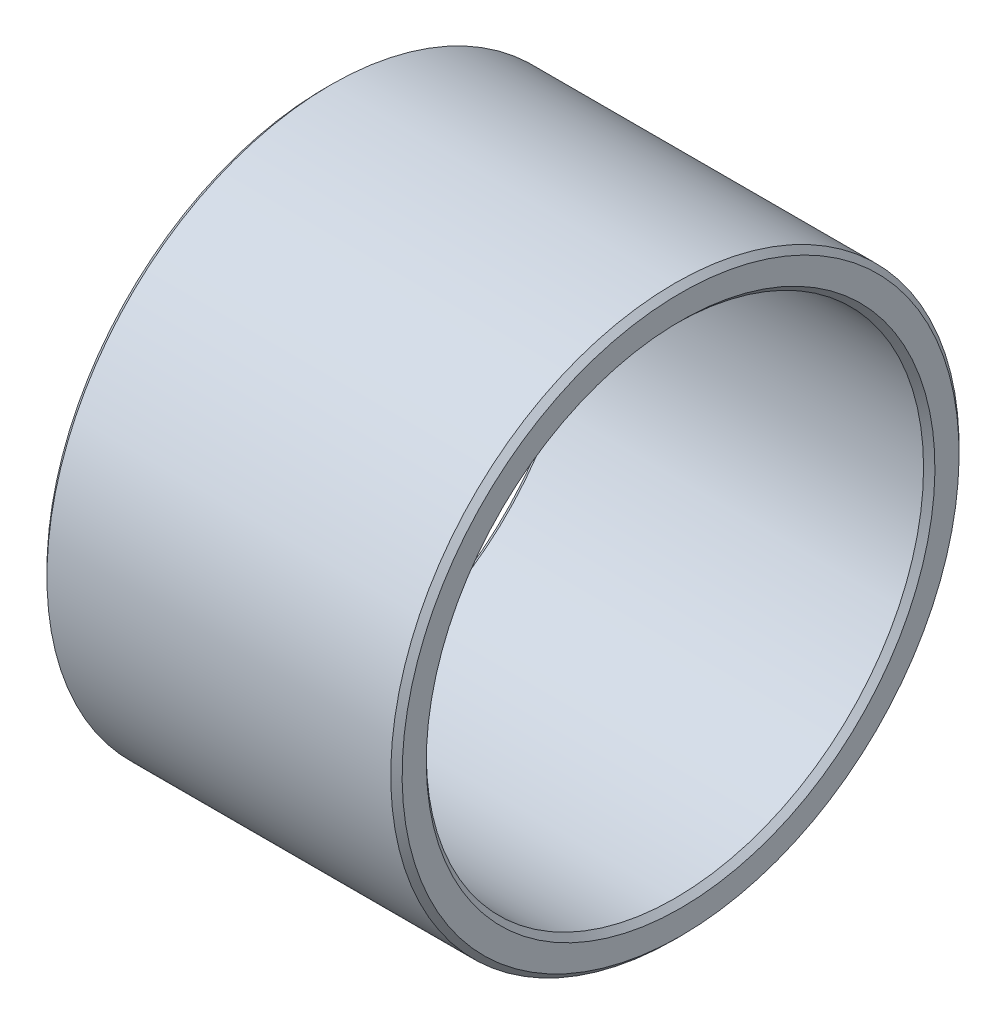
ISO-10303-21;
HEADER;
FILE_DESCRIPTION(('STEP AP214'),'2;1');
FILE_NAME('part.step','',(''),(''),'','','');
FILE_SCHEMA(('AUTOMOTIVE_DESIGN { 1 0 10303 214 1 1 1 1 }'));
ENDSEC;
DATA;
#1=APPLICATION_CONTEXT('core data for automotive mechanical design processes');
#2=APPLICATION_PROTOCOL_DEFINITION('international standard','automotive_design',2000,#1);
#3=PRODUCT_CONTEXT('',#1,'mechanical');
#4=PRODUCT('Part','Part','',(#3));
#5=PRODUCT_RELATED_PRODUCT_CATEGORY('part','',(#4));
#6=PRODUCT_DEFINITION_FORMATION('','',#4);
#7=PRODUCT_DEFINITION_CONTEXT('part definition',#1,'design');
#8=PRODUCT_DEFINITION('design','',#6,#7);
#9=PRODUCT_DEFINITION_SHAPE('','',#8);
#10=(LENGTH_UNIT() NAMED_UNIT(*) SI_UNIT(.MILLI.,.METRE.));
#11=(NAMED_UNIT(*) PLANE_ANGLE_UNIT() SI_UNIT($,.RADIAN.));
#12=(NAMED_UNIT(*) SI_UNIT($,.STERADIAN.) SOLID_ANGLE_UNIT());
#13=UNCERTAINTY_MEASURE_WITH_UNIT(LENGTH_MEASURE(1.E-05),#10,'distance_accuracy_value','');
#14=(GEOMETRIC_REPRESENTATION_CONTEXT(3) GLOBAL_UNCERTAINTY_ASSIGNED_CONTEXT((#13)) GLOBAL_UNIT_ASSIGNED_CONTEXT((#10,
#11,#12)) REPRESENTATION_CONTEXT('',''));
#15=CARTESIAN_POINT('',(0.,0.,0.));
#16=DIRECTION('',(0.,0.,1.));
#17=DIRECTION('',(1.,0.,0.));
#18=AXIS2_PLACEMENT_3D('',#15,#16,#17);
#19=CARTESIAN_POINT('',(0.,-18.75,0.));
#20=DIRECTION('',(-1.,0.,0.));
#21=DIRECTION('',(0.,1.,0.));
#22=AXIS2_PLACEMENT_3D('',#19,#20,#21);
#23=PLANE('',#22);
#24=CARTESIAN_POINT('',(0.,0.,0.));
#25=DIRECTION('',(1.,0.,0.));
#26=DIRECTION('',(0.,-1.,0.));
#27=AXIS2_PLACEMENT_3D('',#24,#25,#26);
#28=CIRCLE('',#27,17.9);
#29=CARTESIAN_POINT('',(0.,-17.9,0.));
#30=VERTEX_POINT('',#29);
#31=EDGE_CURVE('E9',#30,#30,#28,.T.);
#32=ORIENTED_EDGE('',*,*,#31,.T.);
#33=EDGE_LOOP('',(#32));
#34=FACE_BOUND('',#33,.T.);
#35=CARTESIAN_POINT('',(0.,0.,0.));
#36=DIRECTION('',(1.,0.,0.));
#37=DIRECTION('',(0.,-1.,0.));
#38=AXIS2_PLACEMENT_3D('',#35,#36,#37);
#39=CIRCLE('',#38,19.6);
#40=CARTESIAN_POINT('',(0.,-19.6,0.));
#41=VERTEX_POINT('',#40);
#42=EDGE_CURVE('E53',#41,#41,#39,.T.);
#43=ORIENTED_EDGE('',*,*,#42,.F.);
#44=EDGE_LOOP('',(#43));
#45=FACE_BOUND('',#44,.T.);
#46=ADVANCED_FACE('F15',(#34,#45),#23,.T.);
#47=CARTESIAN_POINT('',(0.2,0.,0.));
#48=DIRECTION('',(-1.,0.,0.));
#49=DIRECTION('',(0.,-1.,0.));
#50=AXIS2_PLACEMENT_3D('',#47,#48,#49);
#51=CONICAL_SURFACE('',#50,17.7,0.78539816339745);
#52=CARTESIAN_POINT('',(0.4,0.,0.));
#53=DIRECTION('',(1.,0.,0.));
#54=DIRECTION('',(0.,-1.,0.));
#55=AXIS2_PLACEMENT_3D('',#52,#53,#54);
#56=CIRCLE('',#55,17.5);
#57=CARTESIAN_POINT('',(0.4,-17.5,0.));
#58=VERTEX_POINT('',#57);
#59=EDGE_CURVE('E22',#58,#58,#56,.T.);
#60=ORIENTED_EDGE('',*,*,#59,.T.);
#61=EDGE_LOOP('',(#60));
#62=FACE_BOUND('',#61,.T.);
#63=ORIENTED_EDGE('',*,*,#31,.F.);
#64=EDGE_LOOP('',(#63));
#65=FACE_BOUND('',#64,.T.);
#66=ADVANCED_FACE('F82',(#62,#65),#51,.F.);
#67=CARTESIAN_POINT('',(12.5,0.,0.));
#68=DIRECTION('',(-1.,0.,0.));
#69=DIRECTION('',(0.,-1.,0.));
#70=AXIS2_PLACEMENT_3D('',#67,#68,#69);
#71=CYLINDRICAL_SURFACE('',#70,17.5);
#72=CARTESIAN_POINT('',(24.6,0.,0.));
#73=DIRECTION('',(1.,0.,0.));
#74=DIRECTION('',(0.,-1.,0.));
#75=AXIS2_PLACEMENT_3D('',#72,#73,#74);
#76=CIRCLE('',#75,17.5);
#77=CARTESIAN_POINT('',(24.6,-17.5,0.));
#78=VERTEX_POINT('',#77);
#79=EDGE_CURVE('E58',#78,#78,#76,.T.);
#80=ORIENTED_EDGE('',*,*,#79,.T.);
#81=EDGE_LOOP('',(#80));
#82=FACE_BOUND('',#81,.T.);
#83=ORIENTED_EDGE('',*,*,#59,.F.);
#84=EDGE_LOOP('',(#83));
#85=FACE_BOUND('',#84,.T.);
#86=ADVANCED_FACE('F66',(#82,#85),#71,.F.);
#87=CARTESIAN_POINT('',(24.8,0.,0.));
#88=DIRECTION('',(1.,0.,0.));
#89=DIRECTION('',(0.,-1.,0.));
#90=AXIS2_PLACEMENT_3D('',#87,#88,#89);
#91=CONICAL_SURFACE('',#90,17.7,0.785398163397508);
#92=CARTESIAN_POINT('',(25.,0.,0.));
#93=DIRECTION('',(1.,0.,0.));
#94=DIRECTION('',(0.,-1.,0.));
#95=AXIS2_PLACEMENT_3D('',#92,#93,#94);
#96=CIRCLE('',#95,17.9);
#97=CARTESIAN_POINT('',(25.,-17.9,0.));
#98=VERTEX_POINT('',#97);
#99=EDGE_CURVE('E63',#98,#98,#96,.T.);
#100=ORIENTED_EDGE('',*,*,#99,.T.);
#101=EDGE_LOOP('',(#100));
#102=FACE_BOUND('',#101,.T.);
#103=ORIENTED_EDGE('',*,*,#79,.F.);
#104=EDGE_LOOP('',(#103));
#105=FACE_BOUND('',#104,.T.);
#106=ADVANCED_FACE('F69',(#102,#105),#91,.F.);
#107=CARTESIAN_POINT('',(25.,-18.75,0.));
#108=DIRECTION('',(1.,0.,0.));
#109=DIRECTION('',(0.,-1.,0.));
#110=AXIS2_PLACEMENT_3D('',#107,#108,#109);
#111=PLANE('',#110);
#112=CARTESIAN_POINT('',(25.,0.,0.));
#113=DIRECTION('',(1.,0.,0.));
#114=DIRECTION('',(0.,-1.,0.));
#115=AXIS2_PLACEMENT_3D('',#112,#113,#114);
#116=CIRCLE('',#115,19.6);
#117=CARTESIAN_POINT('',(25.,-19.6,0.));
#118=VERTEX_POINT('',#117);
#119=EDGE_CURVE('E61',#118,#118,#116,.T.);
#120=ORIENTED_EDGE('',*,*,#119,.T.);
#121=EDGE_LOOP('',(#120));
#122=FACE_BOUND('',#121,.T.);
#123=ORIENTED_EDGE('',*,*,#99,.F.);
#124=EDGE_LOOP('',(#123));
#125=FACE_BOUND('',#124,.T.);
#126=ADVANCED_FACE('F71',(#122,#125),#111,.T.);
#127=CARTESIAN_POINT('',(24.8,0.,0.));
#128=DIRECTION('',(-1.,0.,0.));
#129=DIRECTION('',(0.,-1.,0.));
#130=AXIS2_PLACEMENT_3D('',#127,#128,#129);
#131=CONICAL_SURFACE('',#130,19.8,0.785398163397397);
#132=CARTESIAN_POINT('',(24.6,0.,0.));
#133=DIRECTION('',(1.,0.,0.));
#134=DIRECTION('',(0.,-1.,0.));
#135=AXIS2_PLACEMENT_3D('',#132,#133,#134);
#136=CIRCLE('',#135,20.);
#137=CARTESIAN_POINT('',(24.6,-20.,0.));
#138=VERTEX_POINT('',#137);
#139=EDGE_CURVE('E55',#138,#138,#136,.T.);
#140=ORIENTED_EDGE('',*,*,#139,.T.);
#141=EDGE_LOOP('',(#140));
#142=FACE_BOUND('',#141,.T.);
#143=ORIENTED_EDGE('',*,*,#119,.F.);
#144=EDGE_LOOP('',(#143));
#145=FACE_BOUND('',#144,.T.);
#146=ADVANCED_FACE('F79',(#142,#145),#131,.T.);
#147=CARTESIAN_POINT('',(12.5,0.,0.));
#148=DIRECTION('',(-1.,0.,0.));
#149=DIRECTION('',(0.,-1.,0.));
#150=AXIS2_PLACEMENT_3D('',#147,#148,#149);
#151=CYLINDRICAL_SURFACE('',#150,20.);
#152=CARTESIAN_POINT('',(0.4,0.,0.));
#153=DIRECTION('',(1.,0.,0.));
#154=DIRECTION('',(0.,-1.,0.));
#155=AXIS2_PLACEMENT_3D('',#152,#153,#154);
#156=CIRCLE('',#155,20.);
#157=CARTESIAN_POINT('',(0.4,-20.,0.));
#158=VERTEX_POINT('',#157);
#159=EDGE_CURVE('E49',#158,#158,#156,.T.);
#160=ORIENTED_EDGE('',*,*,#159,.T.);
#161=EDGE_LOOP('',(#160));
#162=FACE_BOUND('',#161,.T.);
#163=ORIENTED_EDGE('',*,*,#139,.F.);
#164=EDGE_LOOP('',(#163));
#165=FACE_BOUND('',#164,.T.);
#166=ADVANCED_FACE('F50',(#162,#165),#151,.T.);
#167=CARTESIAN_POINT('',(0.2,0.,0.));
#168=DIRECTION('',(1.,0.,0.));
#169=DIRECTION('',(0.,-1.,0.));
#170=AXIS2_PLACEMENT_3D('',#167,#168,#169);
#171=CONICAL_SURFACE('',#170,19.8,0.785398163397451);
#172=ORIENTED_EDGE('',*,*,#42,.T.);
#173=EDGE_LOOP('',(#172));
#174=FACE_BOUND('',#173,.T.);
#175=ORIENTED_EDGE('',*,*,#159,.F.);
#176=EDGE_LOOP('',(#175));
#177=FACE_BOUND('',#176,.T.);
#178=ADVANCED_FACE('F92',(#174,#177),#171,.T.);
#179=CLOSED_SHELL('',(#46,#66,#86,#106,#126,#146,#166,#178));
#180=MANIFOLD_SOLID_BREP('B1',#179);
#181=ADVANCED_BREP_SHAPE_REPRESENTATION('',(#18,#180),#14);
#182=SHAPE_DEFINITION_REPRESENTATION(#9,#181);
ENDSEC;
END-ISO-10303-21;
